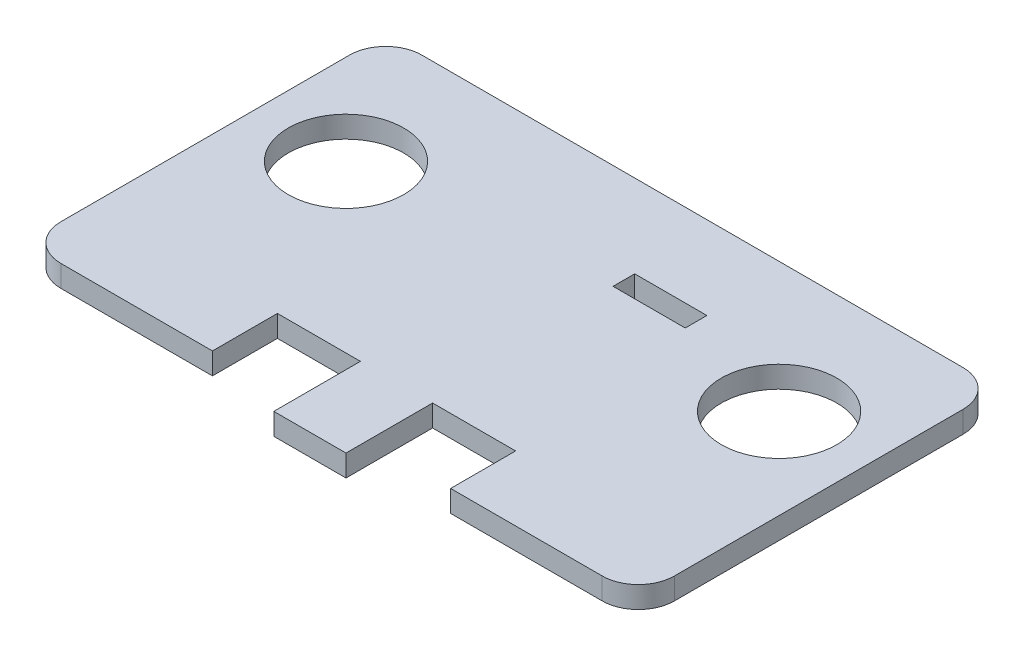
from build123d import *

# Parameters (mm, degrees)
SKETCH1_W           = 85
SKETCH1_H           = 50
BOSS_EXTRUDE1_DEPTH = 3
FILLET1_R           = 5
SKETCH2_R           = 8
CUT_EXTRUDE1_DEPTH  = 3
SKETCH4_W           = 16.5
SKETCH4_H           = 9
CUT_EXTRUDE2_DEPTH  = 3
SKETCH6_W           = 10
SKETCH6_H           = 12
BOSS_EXTRUDE2_DEPTH = 3
SKETCH7_W           = 10
SKETCH7_H           = 3
CUT_EXTRUDE3_DEPTH  = 3


with BuildPart() as part:
    # Sketch1 → Boss-Extrude1 (new body)
    with BuildSketch(Plane(origin=(0, 0, 0), x_dir=(1, 0, 0), z_dir=(0, 1, 0))):
        Rectangle(SKETCH1_W, SKETCH1_H)
    extrude(amount=BOSS_EXTRUDE1_DEPTH)

    # Fillet1
    fillet1_edges = [part.edges().sort_by_distance(p)[0] for p in [
        (42.5, 1.5, 25),
        (-42.5, 1.5, 25),
        (-42.5, 1.5, -25),
        (42.5, 1.5, -25),
    ]]
    fillet(fillet1_edges, radius=FILLET1_R)

    # Sketch2 → Cut-Extrude1 (cut)
    with BuildSketch(Plane(origin=(0, 3, 0), x_dir=(1, 0, 0), z_dir=(0, 1, 0))):
        with Locations(Location((-30, 7, 0), (0, 0, 270))):
            Circle(SKETCH2_R)
        with Locations(Location((30, 7, 0), (0, 0, 270))):
            Circle(SKETCH2_R)
    extrude(amount=-CUT_EXTRUDE1_DEPTH, mode=Mode.SUBTRACT)

    # Sketch4 → Cut-Extrude2 (cut)
    with BuildSketch(Plane(origin=(0, 3, 0), x_dir=(1, 0, 0), z_dir=(0, 1, 0))):
        with Locations((-8.25, -20.5)):
            Rectangle(SKETCH4_W, SKETCH4_H)
    cut_extrude2 = extrude(amount=-CUT_EXTRUDE2_DEPTH, mode=Mode.SUBTRACT)

    # Mirror1: Cut-Extrude2 across plane
    add(cut_extrude2.mirror(Plane(origin=(0, 0, 0), x_dir=(0, 0, 1), z_dir=(1, 0, 0))), mode=Mode.SUBTRACT)

    # Sketch6 → Boss-Extrude2 (add)
    with BuildSketch(Plane(origin=(0, 3, 0), x_dir=(1, 0, 0), z_dir=(0, 1, 0))):
        with Locations((0, -22)):
            Rectangle(SKETCH6_W, SKETCH6_H)
    extrude(amount=-BOSS_EXTRUDE2_DEPTH)

    # Sketch7 → Cut-Extrude3 (cut)
    with BuildSketch(Plane(origin=(0, 3, 0), x_dir=(1, 0, 0), z_dir=(0, 1, 0))):
        with Locations((8.5, 12)):
            Rectangle(SKETCH7_W, SKETCH7_H)
    extrude(amount=-CUT_EXTRUDE3_DEPTH, mode=Mode.SUBTRACT)


solid = part.part
